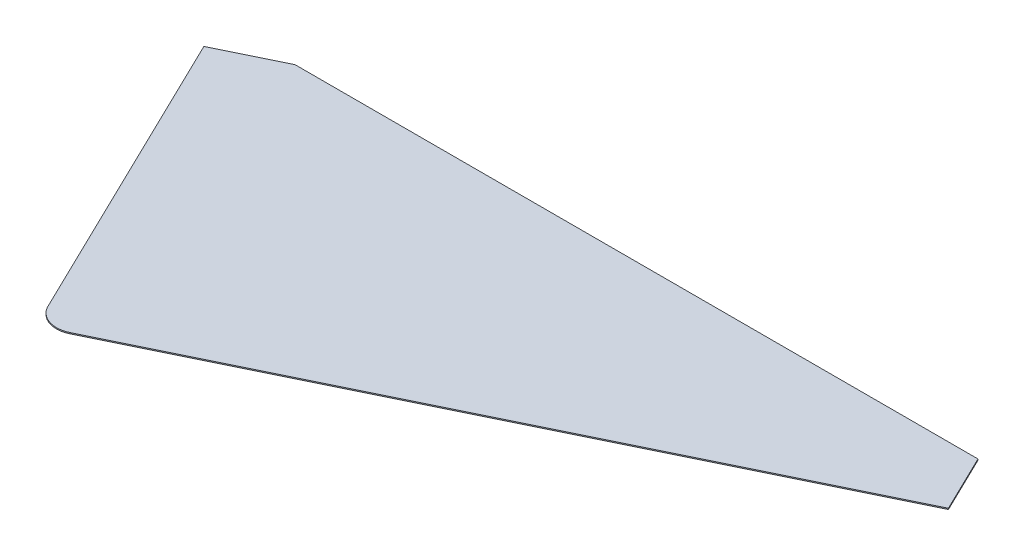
ISO-10303-21;
HEADER;
FILE_DESCRIPTION(('STEP AP214'),'2;1');
FILE_NAME('part.step','',(''),(''),'','','');
FILE_SCHEMA(('AUTOMOTIVE_DESIGN { 1 0 10303 214 1 1 1 1 }'));
ENDSEC;
DATA;
#1=APPLICATION_CONTEXT('core data for automotive mechanical design processes');
#2=APPLICATION_PROTOCOL_DEFINITION('international standard','automotive_design',2000,#1);
#3=PRODUCT_CONTEXT('',#1,'mechanical');
#4=PRODUCT('Part','Part','',(#3));
#5=PRODUCT_RELATED_PRODUCT_CATEGORY('part','',(#4));
#6=PRODUCT_DEFINITION_FORMATION('','',#4);
#7=PRODUCT_DEFINITION_CONTEXT('part definition',#1,'design');
#8=PRODUCT_DEFINITION('design','',#6,#7);
#9=PRODUCT_DEFINITION_SHAPE('','',#8);
#10=(LENGTH_UNIT() NAMED_UNIT(*) SI_UNIT(.MILLI.,.METRE.));
#11=(NAMED_UNIT(*) PLANE_ANGLE_UNIT() SI_UNIT($,.RADIAN.));
#12=(NAMED_UNIT(*) SI_UNIT($,.STERADIAN.) SOLID_ANGLE_UNIT());
#13=UNCERTAINTY_MEASURE_WITH_UNIT(LENGTH_MEASURE(1.E-05),#10,'distance_accuracy_value','');
#14=(GEOMETRIC_REPRESENTATION_CONTEXT(3) GLOBAL_UNCERTAINTY_ASSIGNED_CONTEXT((#13)) GLOBAL_UNIT_ASSIGNED_CONTEXT((#10,
#11,#12)) REPRESENTATION_CONTEXT('',''));
#15=CARTESIAN_POINT('',(0.,0.,0.));
#16=DIRECTION('',(0.,0.,1.));
#17=DIRECTION('',(1.,0.,0.));
#18=AXIS2_PLACEMENT_3D('',#15,#16,#17);
#19=CARTESIAN_POINT('',(-189.016982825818,1.,296.649550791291));
#20=DIRECTION('',(-0.436698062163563,0.,-0.899608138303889));
#21=DIRECTION('',(-0.899608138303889,0.,0.436698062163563));
#22=AXIS2_PLACEMENT_3D('',#19,#20,#21);
#23=PLANE('',#22);
#24=DIRECTION('',(0.899608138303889,0.,-0.436698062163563));
#25=VECTOR('',#24,1.);
#26=CARTESIAN_POINT('',(-189.016982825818,0.,296.649550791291));
#27=LINE('',#26,#25);
#28=CARTESIAN_POINT('',(-189.016982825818,0.,296.649550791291));
#29=VERTEX_POINT('',#28);
#30=CARTESIAN_POINT('',(320.161223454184,0.,49.478447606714));
#31=VERTEX_POINT('',#30);
#32=EDGE_CURVE('E131',#29,#31,#27,.T.);
#33=ORIENTED_EDGE('',*,*,#32,.T.);
#34=DIRECTION('',(0.,-1.,0.));
#35=VECTOR('',#34,1.);
#36=CARTESIAN_POINT('',(320.161223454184,1.,49.478447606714));
#37=LINE('',#36,#35);
#38=CARTESIAN_POINT('',(320.161223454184,1.,49.478447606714));
#39=VERTEX_POINT('',#38);
#40=EDGE_CURVE('E11',#39,#31,#37,.T.);
#41=ORIENTED_EDGE('',*,*,#40,.F.);
#42=DIRECTION('',(0.899608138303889,0.,-0.436698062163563));
#43=VECTOR('',#42,1.);
#44=CARTESIAN_POINT('',(-189.016982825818,1.,296.649550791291));
#45=LINE('',#44,#43);
#46=CARTESIAN_POINT('',(-189.016982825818,1.,296.649550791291));
#47=VERTEX_POINT('',#46);
#48=EDGE_CURVE('E147',#47,#39,#45,.T.);
#49=ORIENTED_EDGE('',*,*,#48,.F.);
#50=DIRECTION('',(0.,-1.,0.));
#51=VECTOR('',#50,1.);
#52=CARTESIAN_POINT('',(-189.016982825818,1.,296.649550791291));
#53=LINE('',#52,#51);
#54=EDGE_CURVE('E128',#47,#29,#53,.T.);
#55=ORIENTED_EDGE('',*,*,#54,.T.);
#56=EDGE_LOOP('',(#33,#41,#49,#55));
#57=FACE_BOUND('',#56,.T.);
#58=ADVANCED_FACE('F44',(#57),#23,.F.);
#59=CARTESIAN_POINT('',(320.161223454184,1.,49.478447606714));
#60=DIRECTION('',(-0.899608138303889,0.,0.436698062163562));
#61=DIRECTION('',(0.436698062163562,0.,0.899608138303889));
#62=AXIS2_PLACEMENT_3D('',#59,#60,#61);
#63=PLANE('',#62);
#64=DIRECTION('',(-0.436698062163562,0.,-0.899608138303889));
#65=VECTOR('',#64,1.);
#66=CARTESIAN_POINT('',(320.161223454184,0.,49.478447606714));
#67=LINE('',#66,#65);
#68=CARTESIAN_POINT('',(296.142830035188,0.,1.38777878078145E-13));
#69=VERTEX_POINT('',#68);
#70=EDGE_CURVE('E139',#31,#69,#67,.T.);
#71=ORIENTED_EDGE('',*,*,#70,.T.);
#72=DIRECTION('',(0.,-1.,0.));
#73=VECTOR('',#72,1.);
#74=CARTESIAN_POINT('',(296.142830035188,1.,1.38777878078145E-13));
#75=LINE('',#74,#73);
#76=CARTESIAN_POINT('',(296.142830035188,1.,1.38777878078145E-13));
#77=VERTEX_POINT('',#76);
#78=EDGE_CURVE('E53',#77,#69,#75,.T.);
#79=ORIENTED_EDGE('',*,*,#78,.F.);
#80=DIRECTION('',(-0.436698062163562,0.,-0.899608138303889));
#81=VECTOR('',#80,1.);
#82=CARTESIAN_POINT('',(320.161223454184,1.,49.478447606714));
#83=LINE('',#82,#81);
#84=EDGE_CURVE('E97',#39,#77,#83,.T.);
#85=ORIENTED_EDGE('',*,*,#84,.F.);
#86=ORIENTED_EDGE('',*,*,#40,.T.);
#87=EDGE_LOOP('',(#71,#79,#85,#86));
#88=FACE_BOUND('',#87,.T.);
#89=ADVANCED_FACE('F179',(#88),#63,.F.);
#90=CARTESIAN_POINT('',(296.142830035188,1.,1.38777878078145E-13));
#91=DIRECTION('',(0.,0.,1.));
#92=DIRECTION('',(1.,0.,0.));
#93=AXIS2_PLACEMENT_3D('',#90,#91,#92);
#94=PLANE('',#93);
#95=DIRECTION('',(-1.,0.,0.));
#96=VECTOR('',#95,1.);
#97=CARTESIAN_POINT('',(296.142830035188,0.,1.38777878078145E-13));
#98=LINE('',#97,#96);
#99=CARTESIAN_POINT('',(-291.963741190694,0.,0.));
#100=VERTEX_POINT('',#99);
#101=EDGE_CURVE('E143',#69,#100,#98,.T.);
#102=ORIENTED_EDGE('',*,*,#101,.T.);
#103=DIRECTION('',(0.,-1.,0.));
#104=VECTOR('',#103,1.);
#105=CARTESIAN_POINT('',(-291.963741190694,1.,0.));
#106=LINE('',#105,#104);
#107=CARTESIAN_POINT('',(-291.963741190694,1.,0.));
#108=VERTEX_POINT('',#107);
#109=EDGE_CURVE('E124',#108,#100,#106,.T.);
#110=ORIENTED_EDGE('',*,*,#109,.F.);
#111=DIRECTION('',(-1.,0.,0.));
#112=VECTOR('',#111,1.);
#113=CARTESIAN_POINT('',(296.142830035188,1.,1.38777878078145E-13));
#114=LINE('',#113,#112);
#115=EDGE_CURVE('E115',#77,#108,#114,.T.);
#116=ORIENTED_EDGE('',*,*,#115,.F.);
#117=ORIENTED_EDGE('',*,*,#78,.T.);
#118=EDGE_LOOP('',(#102,#110,#116,#117));
#119=FACE_BOUND('',#118,.T.);
#120=ADVANCED_FACE('F159',(#119),#94,.F.);
#121=CARTESIAN_POINT('',(-291.963741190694,1.,0.));
#122=DIRECTION('',(0.436698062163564,0.,0.899608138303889));
#123=DIRECTION('',(0.899608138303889,0.,-0.436698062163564));
#124=AXIS2_PLACEMENT_3D('',#121,#122,#123);
#125=PLANE('',#124);
#126=DIRECTION('',(-0.899608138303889,0.,0.436698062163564));
#127=VECTOR('',#126,1.);
#128=CARTESIAN_POINT('',(-291.963741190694,0.,0.));
#129=LINE('',#128,#127);
#130=CARTESIAN_POINT('',(-344.824303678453,0.,25.6601782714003));
#131=VERTEX_POINT('',#130);
#132=EDGE_CURVE('E121',#100,#131,#129,.T.);
#133=ORIENTED_EDGE('',*,*,#132,.T.);
#134=DIRECTION('',(0.,-1.,0.));
#135=VECTOR('',#134,1.);
#136=CARTESIAN_POINT('',(-344.824303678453,1.,25.6601782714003));
#137=LINE('',#136,#135);
#138=CARTESIAN_POINT('',(-344.824303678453,1.,25.6601782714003));
#139=VERTEX_POINT('',#138);
#140=EDGE_CURVE('E119',#139,#131,#137,.T.);
#141=ORIENTED_EDGE('',*,*,#140,.F.);
#142=DIRECTION('',(-0.899608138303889,0.,0.436698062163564));
#143=VECTOR('',#142,1.);
#144=CARTESIAN_POINT('',(-291.963741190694,1.,0.));
#145=LINE('',#144,#143);
#146=EDGE_CURVE('E106',#108,#139,#145,.T.);
#147=ORIENTED_EDGE('',*,*,#146,.F.);
#148=ORIENTED_EDGE('',*,*,#109,.T.);
#149=EDGE_LOOP('',(#133,#141,#147,#148));
#150=FACE_BOUND('',#149,.T.);
#151=ADVANCED_FACE('F116',(#150),#125,.F.);
#152=CARTESIAN_POINT('',(-344.824303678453,1.,25.6601782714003));
#153=DIRECTION('',(0.899608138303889,0.,-0.436698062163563));
#154=DIRECTION('',(-0.436698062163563,0.,-0.899608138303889));
#155=AXIS2_PLACEMENT_3D('',#152,#153,#154);
#156=PLANE('',#155);
#157=DIRECTION('',(0.436698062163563,0.,0.899608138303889));
#158=VECTOR('',#157,1.);
#159=CARTESIAN_POINT('',(-344.824303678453,0.,25.6601782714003));
#160=LINE('',#159,#158);
#161=CARTESIAN_POINT('',(-218.18186565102,0.,286.546538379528));
#162=VERTEX_POINT('',#161);
#163=EDGE_CURVE('E85',#131,#162,#160,.T.);
#164=ORIENTED_EDGE('',*,*,#163,.T.);
#165=DIRECTION('',(0.,-1.,0.));
#166=VECTOR('',#165,1.);
#167=CARTESIAN_POINT('',(-218.18186565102,1.,286.546538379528));
#168=LINE('',#167,#166);
#169=CARTESIAN_POINT('',(-218.18186565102,1.,286.546538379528));
#170=VERTEX_POINT('',#169);
#171=EDGE_CURVE('E123',#170,#162,#168,.T.);
#172=ORIENTED_EDGE('',*,*,#171,.F.);
#173=DIRECTION('',(0.436698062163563,0.,0.899608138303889));
#174=VECTOR('',#173,1.);
#175=CARTESIAN_POINT('',(-344.824303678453,1.,25.6601782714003));
#176=LINE('',#175,#174);
#177=EDGE_CURVE('E109',#139,#170,#176,.T.);
#178=ORIENTED_EDGE('',*,*,#177,.F.);
#179=ORIENTED_EDGE('',*,*,#140,.T.);
#180=EDGE_LOOP('',(#164,#172,#178,#179));
#181=FACE_BOUND('',#180,.T.);
#182=ADVANCED_FACE('F127',(#181),#156,.F.);
#183=CARTESIAN_POINT('',(-198.547918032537,1.,277.015603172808));
#184=DIRECTION('',(0.,-1.,0.));
#185=DIRECTION('',(0.,0.,-1.));
#186=AXIS2_PLACEMENT_3D('',#183,#184,#185);
#187=CYLINDRICAL_SURFACE('',#186,21.825);
#188=CARTESIAN_POINT('',(-198.547918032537,0.,277.015603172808));
#189=DIRECTION('',(0.,1.,0.));
#190=DIRECTION('',(0.,0.,-1.));
#191=AXIS2_PLACEMENT_3D('',#188,#189,#190);
#192=CIRCLE('',#191,21.825);
#193=EDGE_CURVE('E93',#162,#29,#192,.T.);
#194=ORIENTED_EDGE('',*,*,#193,.T.);
#195=ORIENTED_EDGE('',*,*,#54,.F.);
#196=CARTESIAN_POINT('',(-198.547918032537,1.,277.015603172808));
#197=DIRECTION('',(0.,1.,0.));
#198=DIRECTION('',(0.,0.,-1.));
#199=AXIS2_PLACEMENT_3D('',#196,#197,#198);
#200=CIRCLE('',#199,21.825);
#201=EDGE_CURVE('E65',#170,#47,#200,.T.);
#202=ORIENTED_EDGE('',*,*,#201,.F.);
#203=ORIENTED_EDGE('',*,*,#171,.T.);
#204=EDGE_LOOP('',(#194,#195,#202,#203));
#205=FACE_BOUND('',#204,.T.);
#206=ADVANCED_FACE('F170',(#205),#187,.T.);
#207=CARTESIAN_POINT('',(-198.547918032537,1.,277.015603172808));
#208=DIRECTION('',(0.,-1.,0.));
#209=DIRECTION('',(0.,0.,-1.));
#210=AXIS2_PLACEMENT_3D('',#207,#208,#209);
#211=PLANE('',#210);
#212=ORIENTED_EDGE('',*,*,#48,.T.);
#213=ORIENTED_EDGE('',*,*,#84,.T.);
#214=ORIENTED_EDGE('',*,*,#115,.T.);
#215=ORIENTED_EDGE('',*,*,#146,.T.);
#216=ORIENTED_EDGE('',*,*,#177,.T.);
#217=ORIENTED_EDGE('',*,*,#201,.T.);
#218=EDGE_LOOP('',(#212,#213,#214,#215,#216,#217));
#219=FACE_BOUND('',#218,.T.);
#220=ADVANCED_FACE('F107',(#219),#211,.F.);
#221=CARTESIAN_POINT('',(-198.547918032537,0.,277.015603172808));
#222=DIRECTION('',(0.,-1.,0.));
#223=DIRECTION('',(0.,0.,-1.));
#224=AXIS2_PLACEMENT_3D('',#221,#222,#223);
#225=PLANE('',#224);
#226=ORIENTED_EDGE('',*,*,#32,.F.);
#227=ORIENTED_EDGE('',*,*,#193,.F.);
#228=ORIENTED_EDGE('',*,*,#163,.F.);
#229=ORIENTED_EDGE('',*,*,#132,.F.);
#230=ORIENTED_EDGE('',*,*,#101,.F.);
#231=ORIENTED_EDGE('',*,*,#70,.F.);
#232=EDGE_LOOP('',(#226,#227,#228,#229,#230,#231));
#233=FACE_BOUND('',#232,.T.);
#234=ADVANCED_FACE('F162',(#233),#225,.T.);
#235=CLOSED_SHELL('',(#58,#89,#120,#151,#182,#206,#220,#234));
#236=MANIFOLD_SOLID_BREP('B2',#235);
#237=ADVANCED_BREP_SHAPE_REPRESENTATION('',(#18,#236),#14);
#238=SHAPE_DEFINITION_REPRESENTATION(#9,#237);
ENDSEC;
END-ISO-10303-21;
